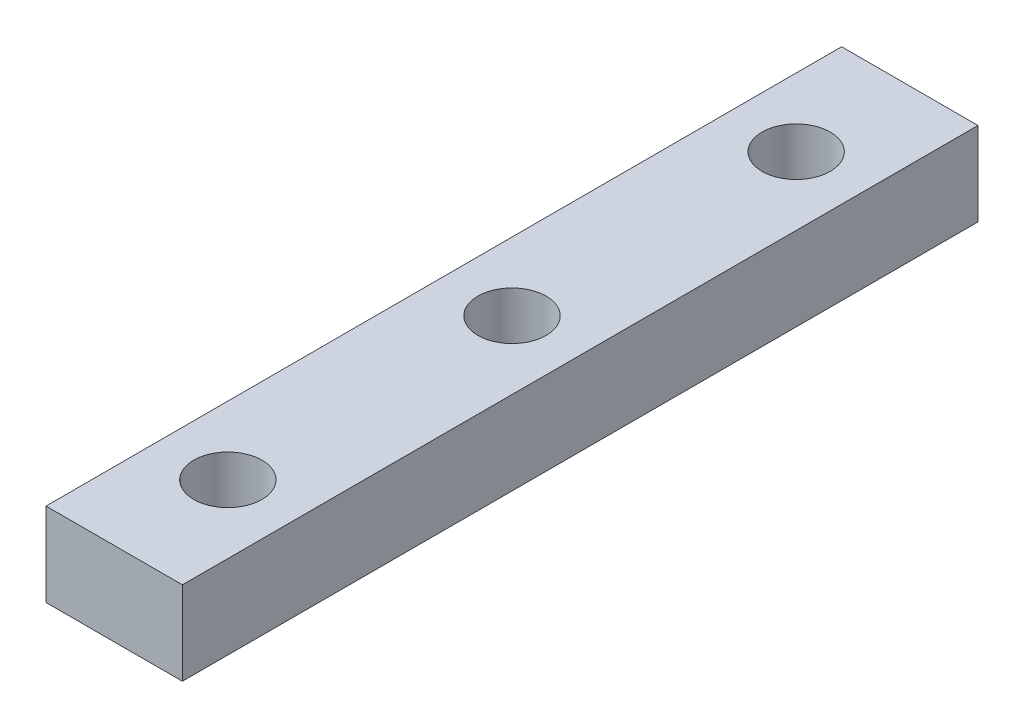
ISO-10303-21;
HEADER;
FILE_DESCRIPTION(('STEP AP214'),'2;1');
FILE_NAME('part.step','',(''),(''),'','','');
FILE_SCHEMA(('AUTOMOTIVE_DESIGN { 1 0 10303 214 1 1 1 1 }'));
ENDSEC;
DATA;
#1=APPLICATION_CONTEXT('core data for automotive mechanical design processes');
#2=APPLICATION_PROTOCOL_DEFINITION('international standard','automotive_design',2000,#1);
#3=PRODUCT_CONTEXT('',#1,'mechanical');
#4=PRODUCT('Part','Part','',(#3));
#5=PRODUCT_RELATED_PRODUCT_CATEGORY('part','',(#4));
#6=PRODUCT_DEFINITION_FORMATION('','',#4);
#7=PRODUCT_DEFINITION_CONTEXT('part definition',#1,'design');
#8=PRODUCT_DEFINITION('design','',#6,#7);
#9=PRODUCT_DEFINITION_SHAPE('','',#8);
#10=(LENGTH_UNIT() NAMED_UNIT(*) SI_UNIT(.MILLI.,.METRE.));
#11=(NAMED_UNIT(*) PLANE_ANGLE_UNIT() SI_UNIT($,.RADIAN.));
#12=(NAMED_UNIT(*) SI_UNIT($,.STERADIAN.) SOLID_ANGLE_UNIT());
#13=UNCERTAINTY_MEASURE_WITH_UNIT(LENGTH_MEASURE(1.E-05),#10,'distance_accuracy_value','');
#14=(GEOMETRIC_REPRESENTATION_CONTEXT(3) GLOBAL_UNCERTAINTY_ASSIGNED_CONTEXT((#13)) GLOBAL_UNIT_ASSIGNED_CONTEXT((#10,
#11,#12)) REPRESENTATION_CONTEXT('',''));
#15=CARTESIAN_POINT('',(0.,0.,0.));
#16=DIRECTION('',(0.,0.,1.));
#17=DIRECTION('',(1.,0.,0.));
#18=AXIS2_PLACEMENT_3D('',#15,#16,#17);
#19=CARTESIAN_POINT('',(6.,-62.6500000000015,60.));
#20=DIRECTION('',(0.,1.,0.));
#21=DIRECTION('',(0.,0.,1.));
#22=AXIS2_PLACEMENT_3D('',#19,#20,#21);
#23=CYLINDRICAL_SURFACE('',#22,1.75);
#24=CARTESIAN_POINT('',(6.,0.,60.));
#25=DIRECTION('',(0.,1.,0.));
#26=DIRECTION('',(0.,0.,1.));
#27=AXIS2_PLACEMENT_3D('',#24,#25,#26);
#28=CIRCLE('',#27,1.75);
#29=CARTESIAN_POINT('',(6.,0.,61.75));
#30=VERTEX_POINT('',#29);
#31=EDGE_CURVE('E110',#30,#30,#28,.T.);
#32=ORIENTED_EDGE('',*,*,#31,.F.);
#33=EDGE_LOOP('',(#32));
#34=FACE_BOUND('',#33,.T.);
#35=CARTESIAN_POINT('',(6.,2.84999999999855,60.));
#36=DIRECTION('',(0.,1.,0.));
#37=DIRECTION('',(0.,0.,1.));
#38=AXIS2_PLACEMENT_3D('',#35,#36,#37);
#39=CIRCLE('',#38,1.75);
#40=CARTESIAN_POINT('',(6.,2.84999999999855,61.75));
#41=VERTEX_POINT('',#40);
#42=EDGE_CURVE('E36',#41,#41,#39,.F.);
#43=ORIENTED_EDGE('',*,*,#42,.F.);
#44=EDGE_LOOP('',(#43));
#45=FACE_BOUND('',#44,.T.);
#46=ADVANCED_FACE('F32',(#34,#45),#23,.F.);
#47=CARTESIAN_POINT('',(6.,-62.6500000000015,35.));
#48=DIRECTION('',(0.,1.,0.));
#49=DIRECTION('',(0.,0.,1.));
#50=AXIS2_PLACEMENT_3D('',#47,#48,#49);
#51=CYLINDRICAL_SURFACE('',#50,1.75);
#52=CARTESIAN_POINT('',(6.,0.,35.));
#53=DIRECTION('',(0.,1.,0.));
#54=DIRECTION('',(0.,0.,1.));
#55=AXIS2_PLACEMENT_3D('',#52,#53,#54);
#56=CIRCLE('',#55,1.75);
#57=CARTESIAN_POINT('',(6.,0.,36.75));
#58=VERTEX_POINT('',#57);
#59=EDGE_CURVE('E135',#58,#58,#56,.T.);
#60=ORIENTED_EDGE('',*,*,#59,.F.);
#61=EDGE_LOOP('',(#60));
#62=FACE_BOUND('',#61,.T.);
#63=CARTESIAN_POINT('',(6.,2.84999999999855,35.));
#64=DIRECTION('',(0.,1.,0.));
#65=DIRECTION('',(0.,0.,1.));
#66=AXIS2_PLACEMENT_3D('',#63,#64,#65);
#67=CIRCLE('',#66,1.75);
#68=CARTESIAN_POINT('',(6.,2.84999999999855,36.75));
#69=VERTEX_POINT('',#68);
#70=EDGE_CURVE('E112',#69,#69,#67,.F.);
#71=ORIENTED_EDGE('',*,*,#70,.F.);
#72=EDGE_LOOP('',(#71));
#73=FACE_BOUND('',#72,.T.);
#74=ADVANCED_FACE('F145',(#62,#73),#51,.F.);
#75=CARTESIAN_POINT('',(6.,-62.6500000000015,10.));
#76=DIRECTION('',(0.,1.,0.));
#77=DIRECTION('',(0.,0.,1.));
#78=AXIS2_PLACEMENT_3D('',#75,#76,#77);
#79=CYLINDRICAL_SURFACE('',#78,1.75);
#80=CARTESIAN_POINT('',(6.,0.,10.));
#81=DIRECTION('',(0.,1.,0.));
#82=DIRECTION('',(0.,0.,1.));
#83=AXIS2_PLACEMENT_3D('',#80,#81,#82);
#84=CIRCLE('',#83,1.75);
#85=CARTESIAN_POINT('',(6.,0.,11.75));
#86=VERTEX_POINT('',#85);
#87=EDGE_CURVE('E102',#86,#86,#84,.T.);
#88=ORIENTED_EDGE('',*,*,#87,.F.);
#89=EDGE_LOOP('',(#88));
#90=FACE_BOUND('',#89,.T.);
#91=CARTESIAN_POINT('',(6.,2.84999999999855,10.));
#92=DIRECTION('',(0.,1.,0.));
#93=DIRECTION('',(0.,0.,1.));
#94=AXIS2_PLACEMENT_3D('',#91,#92,#93);
#95=CIRCLE('',#94,1.75);
#96=CARTESIAN_POINT('',(6.,2.84999999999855,11.75));
#97=VERTEX_POINT('',#96);
#98=EDGE_CURVE('E108',#97,#97,#95,.F.);
#99=ORIENTED_EDGE('',*,*,#98,.F.);
#100=EDGE_LOOP('',(#99));
#101=FACE_BOUND('',#100,.T.);
#102=ADVANCED_FACE('F142',(#90,#101),#79,.F.);
#103=CARTESIAN_POINT('',(0.,0.,70.));
#104=DIRECTION('',(1.,0.,0.));
#105=DIRECTION('',(0.,0.,-1.));
#106=AXIS2_PLACEMENT_3D('',#103,#104,#105);
#107=PLANE('',#106);
#108=DIRECTION('',(0.,-1.,0.));
#109=VECTOR('',#108,1.);
#110=CARTESIAN_POINT('',(0.,0.,0.));
#111=LINE('',#110,#109);
#112=CARTESIAN_POINT('',(0.,7.34999999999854,0.));
#113=VERTEX_POINT('',#112);
#114=CARTESIAN_POINT('',(0.,0.,0.));
#115=VERTEX_POINT('',#114);
#116=EDGE_CURVE('E99',#113,#115,#111,.T.);
#117=ORIENTED_EDGE('',*,*,#116,.T.);
#118=DIRECTION('',(0.,0.,-1.));
#119=VECTOR('',#118,1.);
#120=CARTESIAN_POINT('',(0.,0.,70.));
#121=LINE('',#120,#119);
#122=CARTESIAN_POINT('',(0.,0.,70.));
#123=VERTEX_POINT('',#122);
#124=EDGE_CURVE('E11',#123,#115,#121,.T.);
#125=ORIENTED_EDGE('',*,*,#124,.F.);
#126=DIRECTION('',(0.,-1.,0.));
#127=VECTOR('',#126,1.);
#128=CARTESIAN_POINT('',(0.,0.,70.));
#129=LINE('',#128,#127);
#130=CARTESIAN_POINT('',(0.,7.34999999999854,70.));
#131=VERTEX_POINT('',#130);
#132=EDGE_CURVE('E86',#131,#123,#129,.T.);
#133=ORIENTED_EDGE('',*,*,#132,.F.);
#134=DIRECTION('',(0.,0.,-1.));
#135=VECTOR('',#134,1.);
#136=CARTESIAN_POINT('',(0.,7.34999999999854,70.));
#137=LINE('',#136,#135);
#138=EDGE_CURVE('E95',#131,#113,#137,.T.);
#139=ORIENTED_EDGE('',*,*,#138,.T.);
#140=EDGE_LOOP('',(#117,#125,#133,#139));
#141=FACE_BOUND('',#140,.T.);
#142=ADVANCED_FACE('F34',(#141),#107,.F.);
#143=CARTESIAN_POINT('',(0.,0.,70.));
#144=DIRECTION('',(0.,1.,0.));
#145=DIRECTION('',(0.,0.,1.));
#146=AXIS2_PLACEMENT_3D('',#143,#144,#145);
#147=PLANE('',#146);
#148=ORIENTED_EDGE('',*,*,#31,.T.);
#149=EDGE_LOOP('',(#148));
#150=FACE_BOUND('',#149,.T.);
#151=ORIENTED_EDGE('',*,*,#59,.T.);
#152=EDGE_LOOP('',(#151));
#153=FACE_BOUND('',#152,.T.);
#154=ORIENTED_EDGE('',*,*,#87,.T.);
#155=EDGE_LOOP('',(#154));
#156=FACE_BOUND('',#155,.T.);
#157=DIRECTION('',(1.,0.,0.));
#158=VECTOR('',#157,1.);
#159=CARTESIAN_POINT('',(0.,0.,0.));
#160=LINE('',#159,#158);
#161=CARTESIAN_POINT('',(12.,0.,0.));
#162=VERTEX_POINT('',#161);
#163=EDGE_CURVE('E90',#115,#162,#160,.T.);
#164=ORIENTED_EDGE('',*,*,#163,.T.);
#165=DIRECTION('',(0.,0.,-1.));
#166=VECTOR('',#165,1.);
#167=CARTESIAN_POINT('',(12.,0.,70.));
#168=LINE('',#167,#166);
#169=CARTESIAN_POINT('',(12.,0.,70.));
#170=VERTEX_POINT('',#169);
#171=EDGE_CURVE('E42',#170,#162,#168,.T.);
#172=ORIENTED_EDGE('',*,*,#171,.F.);
#173=DIRECTION('',(1.,0.,0.));
#174=VECTOR('',#173,1.);
#175=CARTESIAN_POINT('',(0.,0.,70.));
#176=LINE('',#175,#174);
#177=EDGE_CURVE('E81',#123,#170,#176,.T.);
#178=ORIENTED_EDGE('',*,*,#177,.F.);
#179=ORIENTED_EDGE('',*,*,#124,.T.);
#180=EDGE_LOOP('',(#164,#172,#178,#179));
#181=FACE_BOUND('',#180,.T.);
#182=ADVANCED_FACE('F89',(#150,#153,#156,#181),#147,.F.);
#183=CARTESIAN_POINT('',(12.,0.,70.));
#184=DIRECTION('',(-1.,0.,0.));
#185=DIRECTION('',(0.,0.,1.));
#186=AXIS2_PLACEMENT_3D('',#183,#184,#185);
#187=PLANE('',#186);
#188=DIRECTION('',(0.,1.,0.));
#189=VECTOR('',#188,1.);
#190=CARTESIAN_POINT('',(12.,0.,0.));
#191=LINE('',#190,#189);
#192=CARTESIAN_POINT('',(12.,7.34999999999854,0.));
#193=VERTEX_POINT('',#192);
#194=EDGE_CURVE('E68',#162,#193,#191,.T.);
#195=ORIENTED_EDGE('',*,*,#194,.T.);
#196=DIRECTION('',(0.,0.,-1.));
#197=VECTOR('',#196,1.);
#198=CARTESIAN_POINT('',(12.,7.34999999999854,70.));
#199=LINE('',#198,#197);
#200=CARTESIAN_POINT('',(12.,7.34999999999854,70.));
#201=VERTEX_POINT('',#200);
#202=EDGE_CURVE('E91',#201,#193,#199,.T.);
#203=ORIENTED_EDGE('',*,*,#202,.F.);
#204=DIRECTION('',(0.,1.,0.));
#205=VECTOR('',#204,1.);
#206=CARTESIAN_POINT('',(12.,0.,70.));
#207=LINE('',#206,#205);
#208=EDGE_CURVE('E84',#170,#201,#207,.T.);
#209=ORIENTED_EDGE('',*,*,#208,.F.);
#210=ORIENTED_EDGE('',*,*,#171,.T.);
#211=EDGE_LOOP('',(#195,#203,#209,#210));
#212=FACE_BOUND('',#211,.T.);
#213=ADVANCED_FACE('F93',(#212),#187,.F.);
#214=CARTESIAN_POINT('',(0.,7.34999999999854,70.));
#215=DIRECTION('',(0.,-1.,0.));
#216=DIRECTION('',(0.,0.,-1.));
#217=AXIS2_PLACEMENT_3D('',#214,#215,#216);
#218=PLANE('',#217);
#219=CARTESIAN_POINT('',(6.,7.34999999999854,60.));
#220=DIRECTION('',(0.,1.,0.));
#221=DIRECTION('',(0.,0.,1.));
#222=AXIS2_PLACEMENT_3D('',#219,#220,#221);
#223=CIRCLE('',#222,3.);
#224=CARTESIAN_POINT('',(6.,7.34999999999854,63.));
#225=VERTEX_POINT('',#224);
#226=EDGE_CURVE('E128',#225,#225,#223,.T.);
#227=ORIENTED_EDGE('',*,*,#226,.F.);
#228=EDGE_LOOP('',(#227));
#229=FACE_BOUND('',#228,.T.);
#230=CARTESIAN_POINT('',(6.,7.34999999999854,35.));
#231=DIRECTION('',(0.,1.,0.));
#232=DIRECTION('',(0.,0.,1.));
#233=AXIS2_PLACEMENT_3D('',#230,#231,#232);
#234=CIRCLE('',#233,3.);
#235=CARTESIAN_POINT('',(6.,7.34999999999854,38.));
#236=VERTEX_POINT('',#235);
#237=EDGE_CURVE('E121',#236,#236,#234,.T.);
#238=ORIENTED_EDGE('',*,*,#237,.F.);
#239=EDGE_LOOP('',(#238));
#240=FACE_BOUND('',#239,.T.);
#241=CARTESIAN_POINT('',(6.,7.34999999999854,10.));
#242=DIRECTION('',(0.,1.,0.));
#243=DIRECTION('',(0.,0.,1.));
#244=AXIS2_PLACEMENT_3D('',#241,#242,#243);
#245=CIRCLE('',#244,3.);
#246=CARTESIAN_POINT('',(6.,7.34999999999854,13.));
#247=VERTEX_POINT('',#246);
#248=EDGE_CURVE('E114',#247,#247,#245,.T.);
#249=ORIENTED_EDGE('',*,*,#248,.F.);
#250=EDGE_LOOP('',(#249));
#251=FACE_BOUND('',#250,.T.);
#252=DIRECTION('',(-1.,0.,0.));
#253=VECTOR('',#252,1.);
#254=CARTESIAN_POINT('',(0.,7.34999999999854,0.));
#255=LINE('',#254,#253);
#256=EDGE_CURVE('E74',#193,#113,#255,.T.);
#257=ORIENTED_EDGE('',*,*,#256,.T.);
#258=ORIENTED_EDGE('',*,*,#138,.F.);
#259=DIRECTION('',(-1.,0.,0.));
#260=VECTOR('',#259,1.);
#261=CARTESIAN_POINT('',(0.,7.34999999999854,70.));
#262=LINE('',#261,#260);
#263=EDGE_CURVE('E51',#201,#131,#262,.T.);
#264=ORIENTED_EDGE('',*,*,#263,.F.);
#265=ORIENTED_EDGE('',*,*,#202,.T.);
#266=EDGE_LOOP('',(#257,#258,#264,#265));
#267=FACE_BOUND('',#266,.T.);
#268=ADVANCED_FACE('F177',(#229,#240,#251,#267),#218,.F.);
#269=CARTESIAN_POINT('',(0.,7.34999999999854,70.));
#270=DIRECTION('',(0.,0.,-1.));
#271=DIRECTION('',(-1.,0.,0.));
#272=AXIS2_PLACEMENT_3D('',#269,#270,#271);
#273=PLANE('',#272);
#274=ORIENTED_EDGE('',*,*,#132,.T.);
#275=ORIENTED_EDGE('',*,*,#177,.T.);
#276=ORIENTED_EDGE('',*,*,#208,.T.);
#277=ORIENTED_EDGE('',*,*,#263,.T.);
#278=EDGE_LOOP('',(#274,#275,#276,#277));
#279=FACE_BOUND('',#278,.T.);
#280=ADVANCED_FACE('F82',(#279),#273,.F.);
#281=CARTESIAN_POINT('',(0.,7.34999999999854,0.));
#282=DIRECTION('',(0.,0.,-1.));
#283=DIRECTION('',(-1.,0.,0.));
#284=AXIS2_PLACEMENT_3D('',#281,#282,#283);
#285=PLANE('',#284);
#286=ORIENTED_EDGE('',*,*,#116,.F.);
#287=ORIENTED_EDGE('',*,*,#256,.F.);
#288=ORIENTED_EDGE('',*,*,#194,.F.);
#289=ORIENTED_EDGE('',*,*,#163,.F.);
#290=EDGE_LOOP('',(#286,#287,#288,#289));
#291=FACE_BOUND('',#290,.T.);
#292=ADVANCED_FACE('F152',(#291),#285,.T.);
#293=CARTESIAN_POINT('',(6.,2.84999999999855,10.));
#294=DIRECTION('',(0.,1.,0.));
#295=DIRECTION('',(0.,0.,1.));
#296=AXIS2_PLACEMENT_3D('',#293,#294,#295);
#297=PLANE('',#296);
#298=CARTESIAN_POINT('',(6.,2.84999999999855,10.));
#299=DIRECTION('',(0.,1.,0.));
#300=DIRECTION('',(0.,0.,1.));
#301=AXIS2_PLACEMENT_3D('',#298,#299,#300);
#302=CIRCLE('',#301,3.);
#303=CARTESIAN_POINT('',(6.,2.84999999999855,13.));
#304=VERTEX_POINT('',#303);
#305=EDGE_CURVE('E111',#304,#304,#302,.T.);
#306=ORIENTED_EDGE('',*,*,#305,.T.);
#307=EDGE_LOOP('',(#306));
#308=FACE_BOUND('',#307,.T.);
#309=ORIENTED_EDGE('',*,*,#98,.T.);
#310=EDGE_LOOP('',(#309));
#311=FACE_BOUND('',#310,.T.);
#312=ADVANCED_FACE('F149',(#308,#311),#297,.T.);
#313=CARTESIAN_POINT('',(6.,2.84999999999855,10.));
#314=DIRECTION('',(0.,1.,0.));
#315=DIRECTION('',(0.,0.,1.));
#316=AXIS2_PLACEMENT_3D('',#313,#314,#315);
#317=CYLINDRICAL_SURFACE('',#316,3.);
#318=ORIENTED_EDGE('',*,*,#305,.F.);
#319=EDGE_LOOP('',(#318));
#320=FACE_BOUND('',#319,.T.);
#321=ORIENTED_EDGE('',*,*,#248,.T.);
#322=EDGE_LOOP('',(#321));
#323=FACE_BOUND('',#322,.T.);
#324=ADVANCED_FACE('F151',(#320,#323),#317,.F.);
#325=CARTESIAN_POINT('',(6.,2.84999999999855,35.));
#326=DIRECTION('',(0.,1.,0.));
#327=DIRECTION('',(0.,0.,1.));
#328=AXIS2_PLACEMENT_3D('',#325,#326,#327);
#329=PLANE('',#328);
#330=CARTESIAN_POINT('',(6.,2.84999999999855,35.));
#331=DIRECTION('',(0.,1.,0.));
#332=DIRECTION('',(0.,0.,1.));
#333=AXIS2_PLACEMENT_3D('',#330,#331,#332);
#334=CIRCLE('',#333,3.);
#335=CARTESIAN_POINT('',(6.,2.84999999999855,38.));
#336=VERTEX_POINT('',#335);
#337=EDGE_CURVE('E115',#336,#336,#334,.T.);
#338=ORIENTED_EDGE('',*,*,#337,.T.);
#339=EDGE_LOOP('',(#338));
#340=FACE_BOUND('',#339,.T.);
#341=ORIENTED_EDGE('',*,*,#70,.T.);
#342=EDGE_LOOP('',(#341));
#343=FACE_BOUND('',#342,.T.);
#344=ADVANCED_FACE('F159',(#340,#343),#329,.T.);
#345=CARTESIAN_POINT('',(6.,2.84999999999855,35.));
#346=DIRECTION('',(0.,1.,0.));
#347=DIRECTION('',(0.,0.,1.));
#348=AXIS2_PLACEMENT_3D('',#345,#346,#347);
#349=CYLINDRICAL_SURFACE('',#348,3.);
#350=ORIENTED_EDGE('',*,*,#337,.F.);
#351=EDGE_LOOP('',(#350));
#352=FACE_BOUND('',#351,.T.);
#353=ORIENTED_EDGE('',*,*,#237,.T.);
#354=EDGE_LOOP('',(#353));
#355=FACE_BOUND('',#354,.T.);
#356=ADVANCED_FACE('F254',(#352,#355),#349,.F.);
#357=CARTESIAN_POINT('',(6.,2.84999999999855,60.));
#358=DIRECTION('',(0.,1.,0.));
#359=DIRECTION('',(0.,0.,1.));
#360=AXIS2_PLACEMENT_3D('',#357,#358,#359);
#361=PLANE('',#360);
#362=CARTESIAN_POINT('',(6.,2.84999999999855,60.));
#363=DIRECTION('',(0.,1.,0.));
#364=DIRECTION('',(0.,0.,1.));
#365=AXIS2_PLACEMENT_3D('',#362,#363,#364);
#366=CIRCLE('',#365,3.);
#367=CARTESIAN_POINT('',(6.,2.84999999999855,63.));
#368=VERTEX_POINT('',#367);
#369=EDGE_CURVE('E289',#368,#368,#366,.T.);
#370=ORIENTED_EDGE('',*,*,#369,.T.);
#371=EDGE_LOOP('',(#370));
#372=FACE_BOUND('',#371,.T.);
#373=ORIENTED_EDGE('',*,*,#42,.T.);
#374=EDGE_LOOP('',(#373));
#375=FACE_BOUND('',#374,.T.);
#376=ADVANCED_FACE('F263',(#372,#375),#361,.T.);
#377=CARTESIAN_POINT('',(6.,2.84999999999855,60.));
#378=DIRECTION('',(0.,1.,0.));
#379=DIRECTION('',(0.,0.,1.));
#380=AXIS2_PLACEMENT_3D('',#377,#378,#379);
#381=CYLINDRICAL_SURFACE('',#380,3.);
#382=ORIENTED_EDGE('',*,*,#369,.F.);
#383=EDGE_LOOP('',(#382));
#384=FACE_BOUND('',#383,.T.);
#385=ORIENTED_EDGE('',*,*,#226,.T.);
#386=EDGE_LOOP('',(#385));
#387=FACE_BOUND('',#386,.T.);
#388=ADVANCED_FACE('F272',(#384,#387),#381,.F.);
#389=CLOSED_SHELL('',(#46,#74,#102,#142,#182,#213,#268,#280,#292,#312,#324,#344,#356,#376,#388));
#390=MANIFOLD_SOLID_BREP('B2',#389);
#391=ADVANCED_BREP_SHAPE_REPRESENTATION('',(#18,#390),#14);
#392=SHAPE_DEFINITION_REPRESENTATION(#9,#391);
ENDSEC;
END-ISO-10303-21;
